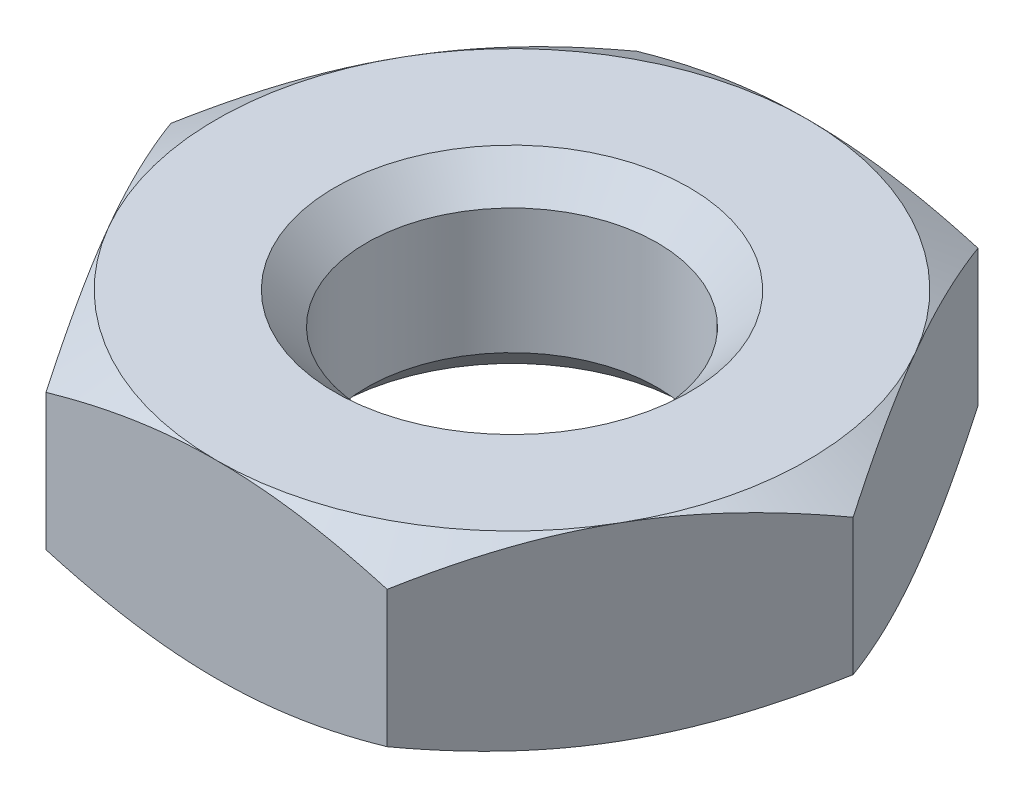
ISO-10303-21;
HEADER;
FILE_DESCRIPTION(('STEP AP214'),'2;1');
FILE_NAME('part.step','',(''),(''),'','','');
FILE_SCHEMA(('AUTOMOTIVE_DESIGN { 1 0 10303 214 1 1 1 1 }'));
ENDSEC;
DATA;
#1=APPLICATION_CONTEXT('core data for automotive mechanical design processes');
#2=APPLICATION_PROTOCOL_DEFINITION('international standard','automotive_design',2000,#1);
#3=PRODUCT_CONTEXT('',#1,'mechanical');
#4=PRODUCT('Part','Part','',(#3));
#5=PRODUCT_RELATED_PRODUCT_CATEGORY('part','',(#4));
#6=PRODUCT_DEFINITION_FORMATION('','',#4);
#7=PRODUCT_DEFINITION_CONTEXT('part definition',#1,'design');
#8=PRODUCT_DEFINITION('design','',#6,#7);
#9=PRODUCT_DEFINITION_SHAPE('','',#8);
#10=(LENGTH_UNIT() NAMED_UNIT(*) SI_UNIT(.MILLI.,.METRE.));
#11=(NAMED_UNIT(*) PLANE_ANGLE_UNIT() SI_UNIT($,.RADIAN.));
#12=(NAMED_UNIT(*) SI_UNIT($,.STERADIAN.) SOLID_ANGLE_UNIT());
#13=UNCERTAINTY_MEASURE_WITH_UNIT(LENGTH_MEASURE(1.E-05),#10,'distance_accuracy_value','');
#14=(GEOMETRIC_REPRESENTATION_CONTEXT(3) GLOBAL_UNCERTAINTY_ASSIGNED_CONTEXT((#13)) GLOBAL_UNIT_ASSIGNED_CONTEXT((#10,
#11,#12)) REPRESENTATION_CONTEXT('',''));
#15=CARTESIAN_POINT('',(0.,0.,0.));
#16=DIRECTION('',(0.,0.,1.));
#17=DIRECTION('',(1.,0.,0.));
#18=AXIS2_PLACEMENT_3D('',#15,#16,#17);
#19=CARTESIAN_POINT('',(0.,0.,0.));
#20=DIRECTION('',(0.,1.,0.));
#21=DIRECTION('',(0.,0.,1.));
#22=AXIS2_PLACEMENT_3D('',#19,#20,#21);
#23=CONICAL_SURFACE('',#22,5.,1.0471975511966);
#24=CARTESIAN_POINT('',(-7.6562098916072,2.39269148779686,5.));
#25=CARTESIAN_POINT('',(-7.43668068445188,2.28660235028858,5.));
#26=CARTESIAN_POINT('',(-7.21663244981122,2.18156779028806,5.));
#27=CARTESIAN_POINT('',(-6.77521729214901,1.97421044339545,5.));
#28=CARTESIAN_POINT('',(-6.55385014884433,1.87188812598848,5.));
#29=CARTESIAN_POINT('',(-6.10832079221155,1.67001886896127,5.));
#30=CARTESIAN_POINT('',(-5.88414983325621,1.57049116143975,5.));
#31=CARTESIAN_POINT('',(-5.43396545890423,1.37571053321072,5.));
#32=CARTESIAN_POINT('',(-5.20795214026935,1.28045738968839,5.));
#33=CARTESIAN_POINT('',(-4.75091730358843,1.09423146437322,5.));
#34=CARTESIAN_POINT('',(-4.51986836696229,1.00332560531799,5.));
#35=CARTESIAN_POINT('',(-4.05504511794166,0.82863336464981,5.));
#36=CARTESIAN_POINT('',(-3.82127050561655,0.744847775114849,5.));
#37=CARTESIAN_POINT('',(-3.3511049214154,0.586647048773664,5.));
#38=CARTESIAN_POINT('',(-3.1147207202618,0.512211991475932,5.));
#39=CARTESIAN_POINT('',(-2.63858935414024,0.375130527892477,5.));
#40=CARTESIAN_POINT('',(-2.39884327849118,0.312480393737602,5.));
#41=CARTESIAN_POINT('',(-1.91583600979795,0.202006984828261,5.));
#42=CARTESIAN_POINT('',(-1.67257390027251,0.154187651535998,5.));
#43=CARTESIAN_POINT('',(-1.18308256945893,0.0766073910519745,5.));
#44=CARTESIAN_POINT('',(-0.936853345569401,0.0468464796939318,5.));
#45=CARTESIAN_POINT('',(-0.567117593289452,0.0176567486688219,5.));
#46=CARTESIAN_POINT('',(-0.444189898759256,0.0105006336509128,5.));
#47=CARTESIAN_POINT('',(-0.198136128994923,0.00139734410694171,5.));
#48=CARTESIAN_POINT('',(-0.0750100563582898,-0.000549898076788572,5.));
#49=CARTESIAN_POINT('',(0.171177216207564,0.000816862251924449,5.));
#50=CARTESIAN_POINT('',(0.294238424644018,0.00412938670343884,5.));
#51=CARTESIAN_POINT('',(0.540114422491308,0.0159317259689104,5.));
#52=CARTESIAN_POINT('',(0.662929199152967,0.024421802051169,5.));
#53=CARTESIAN_POINT('',(0.960602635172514,0.0510977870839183,5.));
#54=CARTESIAN_POINT('',(1.13523252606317,0.071878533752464,5.));
#55=CARTESIAN_POINT('',(1.48312982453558,0.122751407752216,5.));
#56=CARTESIAN_POINT('',(1.65639704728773,0.152844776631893,5.));
#57=CARTESIAN_POINT('',(2.0014599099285,0.221278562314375,5.));
#58=CARTESIAN_POINT('',(2.17325390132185,0.259627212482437,5.));
#59=CARTESIAN_POINT('',(2.51508012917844,0.343401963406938,5.));
#60=CARTESIAN_POINT('',(2.68511247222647,0.388827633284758,5.));
#61=CARTESIAN_POINT('',(3.02759472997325,0.486855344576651,5.));
#62=CARTESIAN_POINT('',(3.20000183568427,0.539605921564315,5.));
#63=CARTESIAN_POINT('',(3.54299370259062,0.650319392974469,5.));
#64=CARTESIAN_POINT('',(3.71357963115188,0.70827869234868,5.));
#65=CARTESIAN_POINT('',(4.0522446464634,0.828212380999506,5.));
#66=CARTESIAN_POINT('',(4.22033243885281,0.890162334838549,5.00000000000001));
#67=CARTESIAN_POINT('',(4.55520387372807,1.01769851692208,5.00000000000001));
#68=CARTESIAN_POINT('',(4.72198695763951,1.08328621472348,5.));
#69=CARTESIAN_POINT('',(4.88816412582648,1.15033293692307,5.));
#70=B_SPLINE_CURVE_WITH_KNOTS('',3,(#24,#25,#26,#27,#28,#29,#30,#31,#32,#33,#34,#35,#36,#37,#38,
#39,#40,#41,#42,#43,#44,#45,#46,#47,#48,#49,#50,#51,#52,#53,#54,#55,#56,#57,#58,#59,#60,#61,#62,
#63,#64,#65,#66,#67,#68,#69),.UNSPECIFIED.,.F.,.F.,(4,2,2,2,2,2,2,2,2,2,2,2,2,2,2,2,2,2,2,2,2,2,
4),(0.,0.731468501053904,1.46306280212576,2.19884351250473,2.93458582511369,3.67936259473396,
4.42422210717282,5.16746683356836,5.9104760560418,6.65368257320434,7.39688974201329,
7.76620341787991,8.13551229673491,8.5047174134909,8.87394116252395,9.40123334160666,
9.92859584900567,10.456486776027,10.9843455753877,11.5251349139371,12.0655538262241,
12.6029309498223,13.1405267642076),.UNSPECIFIED.);
#71=CARTESIAN_POINT('',(0.,0.,5.));
#72=VERTEX_POINT('',#71);
#73=CARTESIAN_POINT('',(-2.88675134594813,0.446581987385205,5.));
#74=VERTEX_POINT('',#73);
#75=EDGE_CURVE('E241',#72,#74,#70,.F.);
#76=ORIENTED_EDGE('',*,*,#75,.T.);
#77=CARTESIAN_POINT('',(-2.88675019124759,0.446582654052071,5.000002));
#78=CARTESIAN_POINT('',(-3.01361208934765,0.373325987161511,4.78027074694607));
#79=CARTESIAN_POINT('',(-3.14155904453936,0.306696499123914,4.5586601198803));
#80=CARTESIAN_POINT('',(-3.39966830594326,0.190396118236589,4.11160176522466));
#81=CARTESIAN_POINT('',(-3.52983519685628,0.140766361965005,3.88614609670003));
#82=CARTESIAN_POINT('',(-3.78857570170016,0.0635265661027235,3.43799439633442));
#83=CARTESIAN_POINT('',(-3.91710902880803,0.0354020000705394,3.21536814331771));
#84=CARTESIAN_POINT('',(-4.11036097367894,0.0101853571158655,2.8806459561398));
#85=CARTESIAN_POINT('',(-4.17482235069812,0.00460678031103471,2.76899557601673));
#86=CARTESIAN_POINT('',(-4.30380461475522,-0.000798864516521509,2.54559174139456));
#87=CARTESIAN_POINT('',(-4.3683254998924,-0.000626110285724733,2.43383829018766));
#88=CARTESIAN_POINT('',(-4.54507978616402,0.00776164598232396,2.12769088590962));
#89=CARTESIAN_POINT('',(-4.65725457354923,0.0218388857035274,1.9333984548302));
#90=CARTESIAN_POINT('',(-4.88085968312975,0.0664713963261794,1.54610304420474));
#91=CARTESIAN_POINT('',(-4.9922892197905,0.0970419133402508,1.35310142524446));
#92=CARTESIAN_POINT('',(-5.21634456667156,0.173457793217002,0.965026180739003));
#93=CARTESIAN_POINT('',(-5.32894210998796,0.219626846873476,0.770001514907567));
#94=CARTESIAN_POINT('',(-5.55245829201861,0.324411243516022,0.382860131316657));
#95=CARTESIAN_POINT('',(-5.66337979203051,0.38300198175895,0.190738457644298));
#96=CARTESIAN_POINT('',(-5.7735038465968,0.446582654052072,-2.00000000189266E-06));
#97=B_SPLINE_CURVE_WITH_KNOTS('',3,(#77,#78,#79,#80,#81,#82,#83,#84,#85,#86,#87,#88,#89,#90,#91,
#92,#93,#94,#95,#96),.UNSPECIFIED.,.F.,.F.,(4,2,2,2,2,2,2,2,2,4),(0.,0.79254018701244,
1.5869848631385,2.36176947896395,2.7487878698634,3.13579429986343,3.80946255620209,
4.48375460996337,5.17299926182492,5.86089121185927),.UNSPECIFIED.);
#98=CARTESIAN_POINT('',(-4.3301270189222,0.,2.5));
#99=VERTEX_POINT('',#98);
#100=EDGE_CURVE('E235',#74,#99,#97,.T.);
#101=ORIENTED_EDGE('',*,*,#100,.T.);
#102=CARTESIAN_POINT('',(0.,0.,0.));
#103=DIRECTION('',(0.,1.,0.));
#104=DIRECTION('',(0.,0.,1.));
#105=AXIS2_PLACEMENT_3D('',#102,#103,#104);
#106=CIRCLE('',#105,5.);
#107=EDGE_CURVE('E338',#99,#72,#106,.T.);
#108=ORIENTED_EDGE('',*,*,#107,.T.);
#109=EDGE_LOOP('',(#76,#101,#108));
#110=FACE_BOUND('',#109,.T.);
#111=ADVANCED_FACE('F14',(#110),#23,.T.);
#112=CARTESIAN_POINT('',(5.77350269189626,0.,0.));
#113=DIRECTION('',(0.,1.,0.));
#114=DIRECTION('',(0.,0.,1.));
#115=AXIS2_PLACEMENT_3D('',#112,#113,#114);
#116=PLANE('',#115);
#117=CARTESIAN_POINT('',(0.,0.,0.));
#118=DIRECTION('',(0.,1.,0.));
#119=DIRECTION('',(0.,0.,1.));
#120=AXIS2_PLACEMENT_3D('',#117,#118,#119);
#121=CIRCLE('',#120,3.);
#122=CARTESIAN_POINT('',(0.,0.,3.));
#123=VERTEX_POINT('',#122);
#124=EDGE_CURVE('E348',#123,#123,#121,.F.);
#125=ORIENTED_EDGE('',*,*,#124,.F.);
#126=EDGE_LOOP('',(#125));
#127=FACE_BOUND('',#126,.T.);
#128=CARTESIAN_POINT('',(4.3301270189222,0.,2.5));
#129=VERTEX_POINT('',#128);
#130=EDGE_CURVE('E332',#72,#129,#106,.T.);
#131=ORIENTED_EDGE('',*,*,#130,.F.);
#132=ORIENTED_EDGE('',*,*,#107,.F.);
#133=CARTESIAN_POINT('',(-4.3301270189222,0.,-2.5));
#134=VERTEX_POINT('',#133);
#135=EDGE_CURVE('E317',#134,#99,#106,.T.);
#136=ORIENTED_EDGE('',*,*,#135,.F.);
#137=CARTESIAN_POINT('',(0.,0.,-5.));
#138=VERTEX_POINT('',#137);
#139=EDGE_CURVE('E344',#138,#134,#106,.T.);
#140=ORIENTED_EDGE('',*,*,#139,.F.);
#141=CARTESIAN_POINT('',(0.,0.,0.));
#142=DIRECTION('',(0.,-1.,0.));
#143=DIRECTION('',(0.,0.,-1.));
#144=AXIS2_PLACEMENT_3D('',#141,#142,#143);
#145=CIRCLE('',#144,5.);
#146=CARTESIAN_POINT('',(4.3301270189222,0.,-2.5));
#147=VERTEX_POINT('',#146);
#148=EDGE_CURVE('E248',#138,#147,#145,.T.);
#149=ORIENTED_EDGE('',*,*,#148,.T.);
#150=EDGE_CURVE('E341',#129,#147,#106,.T.);
#151=ORIENTED_EDGE('',*,*,#150,.F.);
#152=EDGE_LOOP('',(#131,#132,#136,#140,#149,#151));
#153=FACE_BOUND('',#152,.T.);
#154=ADVANCED_FACE('F288',(#127,#153),#116,.F.);
#155=CARTESIAN_POINT('',(-5.77350269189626,0.446581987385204,0.));
#156=VERTEX_POINT('',#155);
#157=EDGE_CURVE('E219',#99,#156,#97,.T.);
#158=ORIENTED_EDGE('',*,*,#157,.T.);
#159=CARTESIAN_POINT('',(-5.7735038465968,0.446582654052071,1.9999999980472E-06));
#160=CARTESIAN_POINT('',(-5.64664194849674,0.373325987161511,-0.219729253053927));
#161=CARTESIAN_POINT('',(-5.51869499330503,0.306696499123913,-0.441339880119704));
#162=CARTESIAN_POINT('',(-5.26058573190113,0.190396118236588,-0.888398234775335));
#163=CARTESIAN_POINT('',(-5.1304188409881,0.140766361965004,-1.11385390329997));
#164=CARTESIAN_POINT('',(-4.87167833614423,0.0635265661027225,-1.56200560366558));
#165=CARTESIAN_POINT('',(-4.74314500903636,0.0354020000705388,-1.78463185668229));
#166=CARTESIAN_POINT('',(-4.54989306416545,0.0101853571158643,-2.1193540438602));
#167=CARTESIAN_POINT('',(-4.48543168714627,0.00460678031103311,-2.23100442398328));
#168=CARTESIAN_POINT('',(-4.35644942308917,-0.000798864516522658,-2.45440825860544));
#169=CARTESIAN_POINT('',(-4.29192853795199,-0.000626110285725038,-2.56616170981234));
#170=CARTESIAN_POINT('',(-4.11517425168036,0.00776164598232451,-2.87230911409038));
#171=CARTESIAN_POINT('',(-4.00299946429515,0.0218388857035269,-3.0666015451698));
#172=CARTESIAN_POINT('',(-3.77939435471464,0.0664713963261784,-3.45389695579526));
#173=CARTESIAN_POINT('',(-3.66796481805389,0.0970419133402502,-3.64689857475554));
#174=CARTESIAN_POINT('',(-3.44390947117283,0.173457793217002,-4.034973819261));
#175=CARTESIAN_POINT('',(-3.33131192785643,0.219626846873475,-4.22999848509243));
#176=CARTESIAN_POINT('',(-3.10779574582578,0.324411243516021,-4.61713986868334));
#177=CARTESIAN_POINT('',(-2.99687424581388,0.383001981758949,-4.8092615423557));
#178=CARTESIAN_POINT('',(-2.88675019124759,0.446582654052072,-5.000002));
#179=B_SPLINE_CURVE_WITH_KNOTS('',3,(#159,#160,#161,#162,#163,#164,#165,#166,#167,#168,#169,
#170,#171,#172,#173,#174,#175,#176,#177,#178),.UNSPECIFIED.,.F.,.F.,(4,2,2,2,2,2,2,2,2,4),(0.,
0.792540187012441,1.5869848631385,2.36176947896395,2.7487878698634,3.13579429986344,
3.80946255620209,4.48375460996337,5.17299926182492,5.86089121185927),.UNSPECIFIED.);
#180=EDGE_CURVE('E213',#156,#134,#179,.T.);
#181=ORIENTED_EDGE('',*,*,#180,.T.);
#182=ORIENTED_EDGE('',*,*,#135,.T.);
#183=EDGE_LOOP('',(#158,#181,#182));
#184=FACE_BOUND('',#183,.T.);
#185=ADVANCED_FACE('F294',(#184),#23,.T.);
#186=CARTESIAN_POINT('',(-2.88675134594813,0.446581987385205,-5.));
#187=VERTEX_POINT('',#186);
#188=EDGE_CURVE('E220',#134,#187,#179,.T.);
#189=ORIENTED_EDGE('',*,*,#188,.T.);
#190=CARTESIAN_POINT('',(-7.65620989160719,2.39269148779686,-5.));
#191=CARTESIAN_POINT('',(-7.43668068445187,2.28660235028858,-5.));
#192=CARTESIAN_POINT('',(-7.21663244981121,2.18156779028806,-5.));
#193=CARTESIAN_POINT('',(-6.775217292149,1.97421044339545,-5.));
#194=CARTESIAN_POINT('',(-6.55385014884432,1.87188812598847,-5.));
#195=CARTESIAN_POINT('',(-6.10832079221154,1.67001886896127,-5.));
#196=CARTESIAN_POINT('',(-5.88414983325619,1.57049116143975,-5.));
#197=CARTESIAN_POINT('',(-5.43396545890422,1.37571053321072,-5.));
#198=CARTESIAN_POINT('',(-5.20795214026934,1.28045738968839,-5.));
#199=CARTESIAN_POINT('',(-4.75091730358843,1.09423146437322,-5.));
#200=CARTESIAN_POINT('',(-4.51986836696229,1.00332560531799,-5.));
#201=CARTESIAN_POINT('',(-4.05504511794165,0.82863336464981,-5.));
#202=CARTESIAN_POINT('',(-3.82127050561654,0.744847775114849,-5.));
#203=CARTESIAN_POINT('',(-3.3511049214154,0.586647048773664,-5.));
#204=CARTESIAN_POINT('',(-3.1147207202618,0.512211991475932,-5.));
#205=CARTESIAN_POINT('',(-2.63858935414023,0.375130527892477,-5.));
#206=CARTESIAN_POINT('',(-2.39884327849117,0.312480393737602,-5.));
#207=CARTESIAN_POINT('',(-1.91583600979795,0.202006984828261,-5.));
#208=CARTESIAN_POINT('',(-1.67257390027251,0.154187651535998,-5.));
#209=CARTESIAN_POINT('',(-1.18308256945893,0.076607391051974,-5.));
#210=CARTESIAN_POINT('',(-0.936853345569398,0.0468464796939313,-5.));
#211=CARTESIAN_POINT('',(-0.567117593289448,0.0176567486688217,-5.));
#212=CARTESIAN_POINT('',(-0.444189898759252,0.0105006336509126,-5.));
#213=CARTESIAN_POINT('',(-0.198136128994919,0.00139734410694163,-5.));
#214=CARTESIAN_POINT('',(-0.0750100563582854,-0.000549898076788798,-5.));
#215=CARTESIAN_POINT('',(0.171177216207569,0.00081686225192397,-5.));
#216=CARTESIAN_POINT('',(0.294238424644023,0.00412938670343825,-5.));
#217=CARTESIAN_POINT('',(0.540114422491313,0.0159317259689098,-5.));
#218=CARTESIAN_POINT('',(0.662929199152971,0.0244218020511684,-5.));
#219=CARTESIAN_POINT('',(0.960602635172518,0.0510977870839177,-5.));
#220=CARTESIAN_POINT('',(1.13523252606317,0.0718785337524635,-5.));
#221=CARTESIAN_POINT('',(1.48312982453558,0.122751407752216,-5.));
#222=CARTESIAN_POINT('',(1.65639704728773,0.152844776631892,-5.));
#223=CARTESIAN_POINT('',(2.0014599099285,0.221278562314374,-5.));
#224=CARTESIAN_POINT('',(2.17325390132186,0.259627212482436,-5.));
#225=CARTESIAN_POINT('',(2.51508012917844,0.343401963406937,-5.));
#226=CARTESIAN_POINT('',(2.68511247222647,0.388827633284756,-5.));
#227=CARTESIAN_POINT('',(3.02759472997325,0.48685534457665,-5.));
#228=CARTESIAN_POINT('',(3.20000183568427,0.539605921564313,-5.));
#229=CARTESIAN_POINT('',(3.54299370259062,0.650319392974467,-5.));
#230=CARTESIAN_POINT('',(3.71357963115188,0.708278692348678,-5.));
#231=CARTESIAN_POINT('',(4.0522446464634,0.828212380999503,-5.));
#232=CARTESIAN_POINT('',(4.22033243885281,0.890162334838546,-5.));
#233=CARTESIAN_POINT('',(4.55520387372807,1.01769851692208,-5.));
#234=CARTESIAN_POINT('',(4.72198695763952,1.08328621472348,-5.));
#235=CARTESIAN_POINT('',(4.88816412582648,1.15033293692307,-5.));
#236=B_SPLINE_CURVE_WITH_KNOTS('',3,(#190,#191,#192,#193,#194,#195,#196,#197,#198,#199,#200,
#201,#202,#203,#204,#205,#206,#207,#208,#209,#210,#211,#212,#213,#214,#215,#216,#217,#218,#219,
#220,#221,#222,#223,#224,#225,#226,#227,#228,#229,#230,#231,#232,#233,#234,#235),.UNSPECIFIED.,
.F.,.F.,(4,2,2,2,2,2,2,2,2,2,2,2,2,2,2,2,2,2,2,2,2,2,4),(0.,0.731468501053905,1.46306280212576,
2.19884351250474,2.93458582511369,3.67936259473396,4.42422210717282,5.16746683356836,
5.91047605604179,6.65368257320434,7.39688974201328,7.76620341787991,8.13551229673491,
8.50471741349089,8.87394116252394,9.40123334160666,9.92859584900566,10.456486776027,
10.9843455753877,11.5251349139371,12.0655538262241,12.6029309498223,13.1405267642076),.UNSPECIFIED.);
#237=EDGE_CURVE('E134',#187,#138,#236,.T.);
#238=ORIENTED_EDGE('',*,*,#237,.T.);
#239=ORIENTED_EDGE('',*,*,#139,.T.);
#240=EDGE_LOOP('',(#189,#238,#239));
#241=FACE_BOUND('',#240,.T.);
#242=ADVANCED_FACE('F170',(#241),#23,.T.);
#243=ORIENTED_EDGE('',*,*,#148,.F.);
#244=CARTESIAN_POINT('',(2.88675134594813,0.446581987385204,-5.));
#245=VERTEX_POINT('',#244);
#246=EDGE_CURVE('E142',#138,#245,#236,.T.);
#247=ORIENTED_EDGE('',*,*,#246,.T.);
#248=CARTESIAN_POINT('',(2.88675019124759,0.446582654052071,-5.000002));
#249=CARTESIAN_POINT('',(3.01361208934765,0.373325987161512,-4.78027074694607));
#250=CARTESIAN_POINT('',(3.14155904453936,0.306696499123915,-4.5586601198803));
#251=CARTESIAN_POINT('',(3.39966830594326,0.19039611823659,-4.11160176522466));
#252=CARTESIAN_POINT('',(3.52983519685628,0.140766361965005,-3.88614609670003));
#253=CARTESIAN_POINT('',(3.78857570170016,0.0635265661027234,-3.43799439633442));
#254=CARTESIAN_POINT('',(3.91710902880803,0.0354020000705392,-3.21536814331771));
#255=CARTESIAN_POINT('',(4.11036097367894,0.0101853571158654,-2.8806459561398));
#256=CARTESIAN_POINT('',(4.17482235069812,0.00460678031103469,-2.76899557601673));
#257=CARTESIAN_POINT('',(4.30380461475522,-0.000798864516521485,-2.54559174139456));
#258=CARTESIAN_POINT('',(4.3683254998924,-0.000626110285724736,-2.43383829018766));
#259=CARTESIAN_POINT('',(4.54507978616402,0.00776164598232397,-2.12769088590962));
#260=CARTESIAN_POINT('',(4.65725457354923,0.0218388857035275,-1.9333984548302));
#261=CARTESIAN_POINT('',(4.88085968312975,0.0664713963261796,-1.54610304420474));
#262=CARTESIAN_POINT('',(4.9922892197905,0.0970419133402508,-1.35310142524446));
#263=CARTESIAN_POINT('',(5.21634456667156,0.173457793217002,-0.965026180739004));
#264=CARTESIAN_POINT('',(5.32894210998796,0.219626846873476,-0.770001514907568));
#265=CARTESIAN_POINT('',(5.55245829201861,0.324411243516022,-0.382860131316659));
#266=CARTESIAN_POINT('',(5.66337979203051,0.38300198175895,-0.1907384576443));
#267=CARTESIAN_POINT('',(5.7735038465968,0.446582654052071,2.00000000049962E-06));
#268=B_SPLINE_CURVE_WITH_KNOTS('',3,(#248,#249,#250,#251,#252,#253,#254,#255,#256,#257,#258,
#259,#260,#261,#262,#263,#264,#265,#266,#267),.UNSPECIFIED.,.F.,.F.,(4,2,2,2,2,2,2,2,2,4),(0.,
0.792540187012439,1.58698486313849,2.36176947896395,2.74878786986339,3.13579429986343,
3.80946255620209,4.48375460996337,5.17299926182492,5.86089121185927),.UNSPECIFIED.);
#269=EDGE_CURVE('E212',#245,#147,#268,.T.);
#270=ORIENTED_EDGE('',*,*,#269,.T.);
#271=EDGE_LOOP('',(#243,#247,#270));
#272=FACE_BOUND('',#271,.T.);
#273=ADVANCED_FACE('F297',(#272),#23,.T.);
#274=ORIENTED_EDGE('',*,*,#150,.T.);
#275=CARTESIAN_POINT('',(5.77350269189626,0.446581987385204,0.));
#276=VERTEX_POINT('',#275);
#277=EDGE_CURVE('E205',#147,#276,#268,.T.);
#278=ORIENTED_EDGE('',*,*,#277,.T.);
#279=CARTESIAN_POINT('',(5.7735038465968,0.446582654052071,-1.99999999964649E-06));
#280=CARTESIAN_POINT('',(5.64664194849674,0.37332598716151,0.219729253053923));
#281=CARTESIAN_POINT('',(5.51869499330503,0.306696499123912,0.4413398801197));
#282=CARTESIAN_POINT('',(5.26058573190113,0.190396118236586,0.888398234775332));
#283=CARTESIAN_POINT('',(5.1304188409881,0.140766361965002,1.11385390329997));
#284=CARTESIAN_POINT('',(4.87167833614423,0.0635265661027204,1.56200560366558));
#285=CARTESIAN_POINT('',(4.74314500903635,0.0354020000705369,1.78463185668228));
#286=CARTESIAN_POINT('',(4.54989306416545,0.0101853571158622,2.1193540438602));
#287=CARTESIAN_POINT('',(4.48543168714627,0.00460678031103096,2.23100442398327));
#288=CARTESIAN_POINT('',(4.35644942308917,-0.000798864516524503,2.45440825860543));
#289=CARTESIAN_POINT('',(4.29192853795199,-0.000626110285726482,2.56616170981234));
#290=CARTESIAN_POINT('',(4.11517425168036,0.0077616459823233,2.87230911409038));
#291=CARTESIAN_POINT('',(4.00299946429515,0.0218388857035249,3.06660154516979));
#292=CARTESIAN_POINT('',(3.77939435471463,0.0664713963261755,3.45389695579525));
#293=CARTESIAN_POINT('',(3.66796481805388,0.0970419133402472,3.64689857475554));
#294=CARTESIAN_POINT('',(3.44390947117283,0.173457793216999,4.03497381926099));
#295=CARTESIAN_POINT('',(3.33131192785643,0.219626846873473,4.22999848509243));
#296=CARTESIAN_POINT('',(3.10779574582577,0.32441124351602,4.61713986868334));
#297=CARTESIAN_POINT('',(2.99687424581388,0.383001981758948,4.8092615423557));
#298=CARTESIAN_POINT('',(2.88675019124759,0.446582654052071,5.000002));
#299=B_SPLINE_CURVE_WITH_KNOTS('',3,(#279,#280,#281,#282,#283,#284,#285,#286,#287,#288,#289,
#290,#291,#292,#293,#294,#295,#296,#297,#298),.UNSPECIFIED.,.F.,.F.,(4,2,2,2,2,2,2,2,2,4),(0.,
0.79254018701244,1.5869848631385,2.36176947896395,2.7487878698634,3.13579429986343,
3.80946255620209,4.48375460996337,5.17299926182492,5.86089121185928),.UNSPECIFIED.);
#300=EDGE_CURVE('E320',#276,#129,#299,.T.);
#301=ORIENTED_EDGE('',*,*,#300,.T.);
#302=EDGE_LOOP('',(#274,#278,#301));
#303=FACE_BOUND('',#302,.T.);
#304=ADVANCED_FACE('F300',(#303),#23,.T.);
#305=ORIENTED_EDGE('',*,*,#130,.T.);
#306=CARTESIAN_POINT('',(2.88675134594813,0.446581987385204,5.));
#307=VERTEX_POINT('',#306);
#308=EDGE_CURVE('E221',#129,#307,#299,.T.);
#309=ORIENTED_EDGE('',*,*,#308,.T.);
#310=EDGE_CURVE('E114',#307,#72,#70,.F.);
#311=ORIENTED_EDGE('',*,*,#310,.T.);
#312=EDGE_LOOP('',(#305,#309,#311));
#313=FACE_BOUND('',#312,.T.);
#314=ADVANCED_FACE('F290',(#313),#23,.T.);
#315=CARTESIAN_POINT('',(0.,3.20000004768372,0.));
#316=DIRECTION('',(0.,1.,0.));
#317=DIRECTION('',(0.,0.,1.));
#318=AXIS2_PLACEMENT_3D('',#315,#316,#317);
#319=CONICAL_SURFACE('',#318,3.,0.785398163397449);
#320=CARTESIAN_POINT('',(0.,2.66000004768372,0.));
#321=DIRECTION('',(0.,-1.,0.));
#322=DIRECTION('',(0.,0.,-1.));
#323=AXIS2_PLACEMENT_3D('',#320,#321,#322);
#324=CIRCLE('',#323,2.46);
#325=CARTESIAN_POINT('',(0.,2.66000004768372,-2.46));
#326=VERTEX_POINT('',#325);
#327=EDGE_CURVE('E260',#326,#326,#324,.T.);
#328=ORIENTED_EDGE('',*,*,#327,.T.);
#329=EDGE_LOOP('',(#328));
#330=FACE_BOUND('',#329,.T.);
#331=CARTESIAN_POINT('',(0.,3.20000004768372,0.));
#332=DIRECTION('',(0.,-1.,0.));
#333=DIRECTION('',(0.,0.,-1.));
#334=AXIS2_PLACEMENT_3D('',#331,#332,#333);
#335=CIRCLE('',#334,3.);
#336=CARTESIAN_POINT('',(0.,3.20000004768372,-3.));
#337=VERTEX_POINT('',#336);
#338=EDGE_CURVE('E256',#337,#337,#335,.T.);
#339=ORIENTED_EDGE('',*,*,#338,.F.);
#340=EDGE_LOOP('',(#339));
#341=FACE_BOUND('',#340,.T.);
#342=ADVANCED_FACE('F168',(#330,#341),#319,.F.);
#343=CARTESIAN_POINT('',(0.,0.,0.));
#344=DIRECTION('',(0.,-1.,0.));
#345=DIRECTION('',(0.,0.,-1.));
#346=AXIS2_PLACEMENT_3D('',#343,#344,#345);
#347=CYLINDRICAL_SURFACE('',#346,2.46);
#348=CARTESIAN_POINT('',(0.,0.54,0.));
#349=DIRECTION('',(0.,-1.,0.));
#350=DIRECTION('',(0.,0.,-1.));
#351=AXIS2_PLACEMENT_3D('',#348,#349,#350);
#352=CIRCLE('',#351,2.46);
#353=CARTESIAN_POINT('',(0.,0.54,-2.46));
#354=VERTEX_POINT('',#353);
#355=EDGE_CURVE('E264',#354,#354,#352,.T.);
#356=ORIENTED_EDGE('',*,*,#355,.T.);
#357=EDGE_LOOP('',(#356));
#358=FACE_BOUND('',#357,.T.);
#359=ORIENTED_EDGE('',*,*,#327,.F.);
#360=EDGE_LOOP('',(#359));
#361=FACE_BOUND('',#360,.T.);
#362=ADVANCED_FACE('F272',(#358,#361),#347,.F.);
#363=CARTESIAN_POINT('',(0.,0.54,0.));
#364=DIRECTION('',(0.,-1.,0.));
#365=DIRECTION('',(0.,0.,-1.));
#366=AXIS2_PLACEMENT_3D('',#363,#364,#365);
#367=CONICAL_SURFACE('',#366,2.46,0.785398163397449);
#368=ORIENTED_EDGE('',*,*,#124,.T.);
#369=EDGE_LOOP('',(#368));
#370=FACE_BOUND('',#369,.T.);
#371=ORIENTED_EDGE('',*,*,#355,.F.);
#372=EDGE_LOOP('',(#371));
#373=FACE_BOUND('',#372,.T.);
#374=ADVANCED_FACE('F275',(#370,#373),#367,.F.);
#375=CARTESIAN_POINT('',(5.77350269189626,3.20000004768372,0.));
#376=DIRECTION('',(0.,1.,0.));
#377=DIRECTION('',(0.,0.,1.));
#378=AXIS2_PLACEMENT_3D('',#375,#376,#377);
#379=PLANE('',#378);
#380=ORIENTED_EDGE('',*,*,#338,.T.);
#381=EDGE_LOOP('',(#380));
#382=FACE_BOUND('',#381,.T.);
#383=CARTESIAN_POINT('',(0.,3.20000004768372,0.));
#384=DIRECTION('',(0.,1.,0.));
#385=DIRECTION('',(0.,0.,1.));
#386=AXIS2_PLACEMENT_3D('',#383,#384,#385);
#387=CIRCLE('',#386,5.);
#388=CARTESIAN_POINT('',(-4.3301270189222,3.20000004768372,2.5));
#389=VERTEX_POINT('',#388);
#390=CARTESIAN_POINT('',(0.,3.20000004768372,5.));
#391=VERTEX_POINT('',#390);
#392=EDGE_CURVE('E19',#389,#391,#387,.T.);
#393=ORIENTED_EDGE('',*,*,#392,.T.);
#394=CARTESIAN_POINT('',(4.33012701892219,3.20000004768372,2.5));
#395=VERTEX_POINT('',#394);
#396=EDGE_CURVE('E9',#391,#395,#387,.T.);
#397=ORIENTED_EDGE('',*,*,#396,.T.);
#398=CARTESIAN_POINT('',(4.3301270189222,3.20000004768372,-2.5));
#399=VERTEX_POINT('',#398);
#400=EDGE_CURVE('E25',#395,#399,#387,.T.);
#401=ORIENTED_EDGE('',*,*,#400,.T.);
#402=CARTESIAN_POINT('',(0.,3.20000004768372,0.));
#403=DIRECTION('',(0.,-1.,0.));
#404=DIRECTION('',(0.,0.,-1.));
#405=AXIS2_PLACEMENT_3D('',#402,#403,#404);
#406=CIRCLE('',#405,5.);
#407=CARTESIAN_POINT('',(0.,3.20000004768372,-5.));
#408=VERTEX_POINT('',#407);
#409=EDGE_CURVE('E252',#408,#399,#406,.T.);
#410=ORIENTED_EDGE('',*,*,#409,.F.);
#411=CARTESIAN_POINT('',(-4.3301270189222,3.20000004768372,-2.5));
#412=VERTEX_POINT('',#411);
#413=EDGE_CURVE('E367',#408,#412,#387,.T.);
#414=ORIENTED_EDGE('',*,*,#413,.T.);
#415=EDGE_CURVE('E360',#412,#389,#387,.T.);
#416=ORIENTED_EDGE('',*,*,#415,.T.);
#417=EDGE_LOOP('',(#393,#397,#401,#410,#414,#416));
#418=FACE_BOUND('',#417,.T.);
#419=ADVANCED_FACE('F277',(#382,#418),#379,.T.);
#420=CARTESIAN_POINT('',(0.,2.75255358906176,0.));
#421=DIRECTION('',(0.,-1.,0.));
#422=DIRECTION('',(0.,0.,-1.));
#423=AXIS2_PLACEMENT_3D('',#420,#421,#422);
#424=CONICAL_SURFACE('',#423,5.775,1.0471975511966);
#425=ORIENTED_EDGE('',*,*,#392,.F.);
#426=CARTESIAN_POINT('',(-5.7735038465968,2.75341739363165,-2.00000000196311E-06));
#427=CARTESIAN_POINT('',(-5.64664194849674,2.82667406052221,0.219729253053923));
#428=CARTESIAN_POINT('',(-5.51869499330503,2.89330354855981,0.441339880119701));
#429=CARTESIAN_POINT('',(-5.26058573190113,3.00960392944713,0.888398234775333));
#430=CARTESIAN_POINT('',(-5.13041884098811,3.05923368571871,1.11385390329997));
#431=CARTESIAN_POINT('',(-4.87167833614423,3.136473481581,1.56200560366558));
#432=CARTESIAN_POINT('',(-4.74314500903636,3.16459804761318,1.78463185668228));
#433=CARTESIAN_POINT('',(-4.54989306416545,3.18981469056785,2.1193540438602));
#434=CARTESIAN_POINT('',(-4.48543168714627,3.19539326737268,2.23100442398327));
#435=CARTESIAN_POINT('',(-4.35644942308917,3.20079891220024,2.45440825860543));
#436=CARTESIAN_POINT('',(-4.291928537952,3.20062615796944,2.56616170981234));
#437=CARTESIAN_POINT('',(-4.11517425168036,3.1922384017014,2.87230911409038));
#438=CARTESIAN_POINT('',(-4.00299946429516,3.17816116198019,3.06660154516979));
#439=CARTESIAN_POINT('',(-3.77939435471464,3.13352865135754,3.45389695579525));
#440=CARTESIAN_POINT('',(-3.66796481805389,3.10295813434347,3.64689857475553));
#441=CARTESIAN_POINT('',(-3.44390947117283,3.02654225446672,4.03497381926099));
#442=CARTESIAN_POINT('',(-3.33131192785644,2.98037320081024,4.22999848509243));
#443=CARTESIAN_POINT('',(-3.10779574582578,2.8755888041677,4.61713986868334));
#444=CARTESIAN_POINT('',(-2.99687424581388,2.81699806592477,4.8092615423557));
#445=CARTESIAN_POINT('',(-2.88675019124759,2.75341739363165,5.000002));
#446=B_SPLINE_CURVE_WITH_KNOTS('',3,(#426,#427,#428,#429,#430,#431,#432,#433,#434,#435,#436,
#437,#438,#439,#440,#441,#442,#443,#444,#445),.UNSPECIFIED.,.F.,.F.,(4,2,2,2,2,2,2,2,2,4),(0.,
0.792540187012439,1.58698486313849,2.36176947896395,2.74878786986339,3.13579429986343,
3.80946255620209,4.48375460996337,5.17299926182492,5.86089121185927),.UNSPECIFIED.);
#447=CARTESIAN_POINT('',(-2.88675134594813,2.75341806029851,5.));
#448=VERTEX_POINT('',#447);
#449=EDGE_CURVE('E140',#389,#448,#446,.T.);
#450=ORIENTED_EDGE('',*,*,#449,.T.);
#451=CARTESIAN_POINT('',(-7.6562098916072,0.807308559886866,5.));
#452=CARTESIAN_POINT('',(-7.43668068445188,0.913397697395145,5.));
#453=CARTESIAN_POINT('',(-7.21663244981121,1.01843225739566,5.));
#454=CARTESIAN_POINT('',(-6.77521729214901,1.22578960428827,5.));
#455=CARTESIAN_POINT('',(-6.55385014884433,1.32811192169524,5.));
#456=CARTESIAN_POINT('',(-6.10832079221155,1.52998117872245,5.));
#457=CARTESIAN_POINT('',(-5.8841498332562,1.62950888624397,5.));
#458=CARTESIAN_POINT('',(-5.43396545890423,1.824289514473,5.));
#459=CARTESIAN_POINT('',(-5.20795214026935,1.91954265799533,5.));
#460=CARTESIAN_POINT('',(-4.75091730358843,2.1057685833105,5.));
#461=CARTESIAN_POINT('',(-4.51986836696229,2.19667444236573,5.));
#462=CARTESIAN_POINT('',(-4.05504511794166,2.37136668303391,5.));
#463=CARTESIAN_POINT('',(-3.82127050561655,2.45515227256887,5.));
#464=CARTESIAN_POINT('',(-3.3511049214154,2.61335299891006,5.));
#465=CARTESIAN_POINT('',(-3.1147207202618,2.68778805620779,5.));
#466=CARTESIAN_POINT('',(-2.63858935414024,2.82486951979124,5.));
#467=CARTESIAN_POINT('',(-2.39884327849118,2.88751965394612,5.));
#468=CARTESIAN_POINT('',(-1.91583600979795,2.99799306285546,5.));
#469=CARTESIAN_POINT('',(-1.67257390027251,3.04581239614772,5.));
#470=CARTESIAN_POINT('',(-1.18308256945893,3.12339265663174,5.));
#471=CARTESIAN_POINT('',(-0.936853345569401,3.15315356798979,5.));
#472=CARTESIAN_POINT('',(-0.567117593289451,3.1823432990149,5.));
#473=CARTESIAN_POINT('',(-0.444189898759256,3.18949941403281,5.));
#474=CARTESIAN_POINT('',(-0.198136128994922,3.19860270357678,5.));
#475=CARTESIAN_POINT('',(-0.0750100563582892,3.20054994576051,5.));
#476=CARTESIAN_POINT('',(0.171177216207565,3.1991831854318,5.));
#477=CARTESIAN_POINT('',(0.294238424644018,3.19587066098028,5.));
#478=CARTESIAN_POINT('',(0.540114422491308,3.18406832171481,5.));
#479=CARTESIAN_POINT('',(0.662929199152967,3.17557824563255,5.));
#480=CARTESIAN_POINT('',(0.960602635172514,3.1489022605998,5.));
#481=CARTESIAN_POINT('',(1.13523252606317,3.12812151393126,5.));
#482=CARTESIAN_POINT('',(1.48312982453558,3.0772486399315,5.));
#483=CARTESIAN_POINT('',(1.65639704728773,3.04715527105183,5.));
#484=CARTESIAN_POINT('',(2.0014599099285,2.97872148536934,5.));
#485=CARTESIAN_POINT('',(2.17325390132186,2.94037283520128,5.));
#486=CARTESIAN_POINT('',(2.51508012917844,2.85659808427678,5.));
#487=CARTESIAN_POINT('',(2.68511247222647,2.81117241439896,5.));
#488=CARTESIAN_POINT('',(3.02759472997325,2.71314470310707,5.));
#489=CARTESIAN_POINT('',(3.20000183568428,2.6603941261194,5.));
#490=CARTESIAN_POINT('',(3.54299370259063,2.54968065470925,5.));
#491=CARTESIAN_POINT('',(3.71357963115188,2.49172135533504,5.));
#492=CARTESIAN_POINT('',(4.0522446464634,2.37178766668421,5.));
#493=CARTESIAN_POINT('',(4.22033243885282,2.30983771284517,5.00000000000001));
#494=CARTESIAN_POINT('',(4.55520387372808,2.18230153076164,5.00000000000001));
#495=CARTESIAN_POINT('',(4.72198695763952,2.11671383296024,5.));
#496=CARTESIAN_POINT('',(4.88816412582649,2.04966711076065,5.));
#497=B_SPLINE_CURVE_WITH_KNOTS('',3,(#451,#452,#453,#454,#455,#456,#457,#458,#459,#460,#461,
#462,#463,#464,#465,#466,#467,#468,#469,#470,#471,#472,#473,#474,#475,#476,#477,#478,#479,#480,
#481,#482,#483,#484,#485,#486,#487,#488,#489,#490,#491,#492,#493,#494,#495,#496),.UNSPECIFIED.,
.F.,.F.,(4,2,2,2,2,2,2,2,2,2,2,2,2,2,2,2,2,2,2,2,2,2,4),(0.,0.731468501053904,1.46306280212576,
2.19884351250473,2.93458582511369,3.67936259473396,4.42422210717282,5.16746683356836,
5.91047605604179,6.65368257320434,7.39688974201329,7.76620341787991,8.13551229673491,
8.5047174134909,8.87394116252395,9.40123334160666,9.92859584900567,10.456486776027,
10.9843455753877,11.5251349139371,12.0655538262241,12.6029309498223,13.1405267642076),.UNSPECIFIED.);
#498=EDGE_CURVE('E133',#448,#391,#497,.T.);
#499=ORIENTED_EDGE('',*,*,#498,.T.);
#500=EDGE_LOOP('',(#425,#450,#499));
#501=FACE_BOUND('',#500,.T.);
#502=ADVANCED_FACE('F167',(#501),#424,.T.);
#503=ORIENTED_EDGE('',*,*,#415,.F.);
#504=CARTESIAN_POINT('',(-2.88675019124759,2.75341739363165,-5.000002));
#505=CARTESIAN_POINT('',(-3.01361208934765,2.82667406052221,-4.78027074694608));
#506=CARTESIAN_POINT('',(-3.14155904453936,2.89330354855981,-4.5586601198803));
#507=CARTESIAN_POINT('',(-3.39966830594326,3.00960392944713,-4.11160176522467));
#508=CARTESIAN_POINT('',(-3.52983519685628,3.05923368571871,-3.88614609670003));
#509=CARTESIAN_POINT('',(-3.78857570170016,3.136473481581,-3.43799439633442));
#510=CARTESIAN_POINT('',(-3.91710902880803,3.16459804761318,-3.21536814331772));
#511=CARTESIAN_POINT('',(-4.11036097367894,3.18981469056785,-2.8806459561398));
#512=CARTESIAN_POINT('',(-4.17482235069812,3.19539326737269,-2.76899557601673));
#513=CARTESIAN_POINT('',(-4.30380461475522,3.20079891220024,-2.54559174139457));
#514=CARTESIAN_POINT('',(-4.36832549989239,3.20062615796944,-2.43383829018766));
#515=CARTESIAN_POINT('',(-4.54507978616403,3.1922384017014,-2.12769088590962));
#516=CARTESIAN_POINT('',(-4.65725457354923,3.17816116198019,-1.93339845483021));
#517=CARTESIAN_POINT('',(-4.88085968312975,3.13352865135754,-1.54610304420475));
#518=CARTESIAN_POINT('',(-4.9922892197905,3.10295813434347,-1.35310142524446));
#519=CARTESIAN_POINT('',(-5.21634456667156,3.02654225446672,-0.965026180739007));
#520=CARTESIAN_POINT('',(-5.32894210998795,2.98037320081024,-0.77000151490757));
#521=CARTESIAN_POINT('',(-5.55245829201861,2.8755888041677,-0.38286013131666));
#522=CARTESIAN_POINT('',(-5.66337979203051,2.81699806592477,-0.190738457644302));
#523=CARTESIAN_POINT('',(-5.7735038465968,2.75341739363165,1.99999999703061E-06));
#524=B_SPLINE_CURVE_WITH_KNOTS('',3,(#504,#505,#506,#507,#508,#509,#510,#511,#512,#513,#514,
#515,#516,#517,#518,#519,#520,#521,#522,#523),.UNSPECIFIED.,.F.,.F.,(4,2,2,2,2,2,2,2,2,4),(0.,
0.792540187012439,1.58698486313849,2.36176947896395,2.74878786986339,3.13579429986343,
3.80946255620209,4.48375460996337,5.17299926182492,5.86089121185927),.UNSPECIFIED.);
#525=CARTESIAN_POINT('',(-5.77350269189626,2.75341806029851,0.));
#526=VERTEX_POINT('',#525);
#527=EDGE_CURVE('E32',#412,#526,#524,.T.);
#528=ORIENTED_EDGE('',*,*,#527,.T.);
#529=EDGE_CURVE('E394',#526,#389,#446,.T.);
#530=ORIENTED_EDGE('',*,*,#529,.T.);
#531=EDGE_LOOP('',(#503,#528,#530));
#532=FACE_BOUND('',#531,.T.);
#533=ADVANCED_FACE('F393',(#532),#424,.T.);
#534=ORIENTED_EDGE('',*,*,#413,.F.);
#535=CARTESIAN_POINT('',(-7.65620989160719,0.807308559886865,-5.));
#536=CARTESIAN_POINT('',(-7.43668068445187,0.913397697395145,-5.));
#537=CARTESIAN_POINT('',(-7.2166324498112,1.01843225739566,-5.));
#538=CARTESIAN_POINT('',(-6.775217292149,1.22578960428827,-5.));
#539=CARTESIAN_POINT('',(-6.55385014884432,1.32811192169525,-5.));
#540=CARTESIAN_POINT('',(-6.10832079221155,1.52998117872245,-5.));
#541=CARTESIAN_POINT('',(-5.8841498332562,1.62950888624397,-5.));
#542=CARTESIAN_POINT('',(-5.43396545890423,1.824289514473,-5.));
#543=CARTESIAN_POINT('',(-5.20795214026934,1.91954265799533,-5.));
#544=CARTESIAN_POINT('',(-4.75091730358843,2.1057685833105,-5.));
#545=CARTESIAN_POINT('',(-4.51986836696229,2.19667444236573,-5.));
#546=CARTESIAN_POINT('',(-4.05504511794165,2.37136668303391,-5.));
#547=CARTESIAN_POINT('',(-3.82127050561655,2.45515227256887,-5.));
#548=CARTESIAN_POINT('',(-3.3511049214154,2.61335299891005,-5.));
#549=CARTESIAN_POINT('',(-3.1147207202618,2.68778805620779,-5.));
#550=CARTESIAN_POINT('',(-2.63858935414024,2.82486951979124,-5.));
#551=CARTESIAN_POINT('',(-2.39884327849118,2.88751965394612,-5.));
#552=CARTESIAN_POINT('',(-1.91583600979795,2.99799306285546,-5.));
#553=CARTESIAN_POINT('',(-1.67257390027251,3.04581239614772,-5.));
#554=CARTESIAN_POINT('',(-1.18308256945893,3.12339265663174,-5.));
#555=CARTESIAN_POINT('',(-0.936853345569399,3.15315356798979,-5.));
#556=CARTESIAN_POINT('',(-0.567117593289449,3.1823432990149,-5.));
#557=CARTESIAN_POINT('',(-0.444189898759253,3.18949941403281,-5.));
#558=CARTESIAN_POINT('',(-0.198136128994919,3.19860270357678,-5.));
#559=CARTESIAN_POINT('',(-0.0750100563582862,3.20054994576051,-5.));
#560=CARTESIAN_POINT('',(0.171177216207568,3.1991831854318,-5.));
#561=CARTESIAN_POINT('',(0.294238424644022,3.19587066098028,-5.));
#562=CARTESIAN_POINT('',(0.540114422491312,3.18406832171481,-5.));
#563=CARTESIAN_POINT('',(0.662929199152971,3.17557824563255,-5.));
#564=CARTESIAN_POINT('',(0.960602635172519,3.1489022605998,-5.));
#565=CARTESIAN_POINT('',(1.13523252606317,3.12812151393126,-5.));
#566=CARTESIAN_POINT('',(1.48312982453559,3.0772486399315,-5.));
#567=CARTESIAN_POINT('',(1.65639704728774,3.04715527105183,-5.));
#568=CARTESIAN_POINT('',(2.0014599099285,2.97872148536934,-5.));
#569=CARTESIAN_POINT('',(2.17325390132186,2.94037283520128,-5.));
#570=CARTESIAN_POINT('',(2.51508012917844,2.85659808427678,-5.));
#571=CARTESIAN_POINT('',(2.68511247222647,2.81117241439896,-5.));
#572=CARTESIAN_POINT('',(3.02759472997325,2.71314470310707,-5.));
#573=CARTESIAN_POINT('',(3.20000183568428,2.6603941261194,-5.));
#574=CARTESIAN_POINT('',(3.54299370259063,2.54968065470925,-5.));
#575=CARTESIAN_POINT('',(3.71357963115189,2.49172135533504,-5.));
#576=CARTESIAN_POINT('',(4.0522446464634,2.37178766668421,-5.));
#577=CARTESIAN_POINT('',(4.22033243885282,2.30983771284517,-5.));
#578=CARTESIAN_POINT('',(4.55520387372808,2.18230153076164,-5.));
#579=CARTESIAN_POINT('',(4.72198695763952,2.11671383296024,-5.));
#580=CARTESIAN_POINT('',(4.88816412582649,2.04966711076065,-5.));
#581=B_SPLINE_CURVE_WITH_KNOTS('',3,(#535,#536,#537,#538,#539,#540,#541,#542,#543,#544,#545,
#546,#547,#548,#549,#550,#551,#552,#553,#554,#555,#556,#557,#558,#559,#560,#561,#562,#563,#564,
#565,#566,#567,#568,#569,#570,#571,#572,#573,#574,#575,#576,#577,#578,#579,#580),.UNSPECIFIED.,
.F.,.F.,(4,2,2,2,2,2,2,2,2,2,2,2,2,2,2,2,2,2,2,2,2,2,4),(0.,0.731468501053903,1.46306280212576,
2.19884351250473,2.93458582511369,3.67936259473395,4.42422210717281,5.16746683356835,
5.91047605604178,6.65368257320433,7.39688974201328,7.76620341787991,8.1355122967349,
8.50471741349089,8.87394116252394,9.40123334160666,9.92859584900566,10.456486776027,
10.9843455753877,11.5251349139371,12.0655538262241,12.6029309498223,13.1405267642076),.UNSPECIFIED.);
#582=CARTESIAN_POINT('',(-2.88675134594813,2.75341806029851,-5.));
#583=VERTEX_POINT('',#582);
#584=EDGE_CURVE('E40',#408,#583,#581,.F.);
#585=ORIENTED_EDGE('',*,*,#584,.T.);
#586=EDGE_CURVE('E388',#583,#412,#524,.T.);
#587=ORIENTED_EDGE('',*,*,#586,.T.);
#588=EDGE_LOOP('',(#534,#585,#587));
#589=FACE_BOUND('',#588,.T.);
#590=ADVANCED_FACE('F387',(#589),#424,.T.);
#591=ORIENTED_EDGE('',*,*,#409,.T.);
#592=CARTESIAN_POINT('',(5.7735038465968,2.75341739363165,2.00000000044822E-06));
#593=CARTESIAN_POINT('',(5.64664194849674,2.82667406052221,-0.219729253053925));
#594=CARTESIAN_POINT('',(5.51869499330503,2.89330354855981,-0.441339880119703));
#595=CARTESIAN_POINT('',(5.26058573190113,3.00960392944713,-0.888398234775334));
#596=CARTESIAN_POINT('',(5.13041884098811,3.05923368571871,-1.11385390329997));
#597=CARTESIAN_POINT('',(4.87167833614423,3.136473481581,-1.56200560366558));
#598=CARTESIAN_POINT('',(4.74314500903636,3.16459804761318,-1.78463185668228));
#599=CARTESIAN_POINT('',(4.54989306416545,3.18981469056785,-2.1193540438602));
#600=CARTESIAN_POINT('',(4.48543168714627,3.19539326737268,-2.23100442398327));
#601=CARTESIAN_POINT('',(4.35644942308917,3.20079891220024,-2.45440825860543));
#602=CARTESIAN_POINT('',(4.291928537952,3.20062615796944,-2.56616170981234));
#603=CARTESIAN_POINT('',(4.11517425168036,3.1922384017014,-2.87230911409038));
#604=CARTESIAN_POINT('',(4.00299946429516,3.17816116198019,-3.06660154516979));
#605=CARTESIAN_POINT('',(3.77939435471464,3.13352865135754,-3.45389695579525));
#606=CARTESIAN_POINT('',(3.66796481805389,3.10295813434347,-3.64689857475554));
#607=CARTESIAN_POINT('',(3.44390947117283,3.02654225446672,-4.03497381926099));
#608=CARTESIAN_POINT('',(3.33131192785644,2.98037320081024,-4.22999848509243));
#609=CARTESIAN_POINT('',(3.10779574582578,2.8755888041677,-4.61713986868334));
#610=CARTESIAN_POINT('',(2.99687424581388,2.81699806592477,-4.8092615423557));
#611=CARTESIAN_POINT('',(2.88675019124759,2.75341739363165,-5.000002));
#612=B_SPLINE_CURVE_WITH_KNOTS('',3,(#592,#593,#594,#595,#596,#597,#598,#599,#600,#601,#602,
#603,#604,#605,#606,#607,#608,#609,#610,#611),.UNSPECIFIED.,.F.,.F.,(4,2,2,2,2,2,2,2,2,4),(0.,
0.79254018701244,1.58698486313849,2.36176947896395,2.74878786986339,3.13579429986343,
3.80946255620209,4.48375460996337,5.17299926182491,5.86089121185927),.UNSPECIFIED.);
#613=CARTESIAN_POINT('',(2.88675134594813,2.75341806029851,-5.));
#614=VERTEX_POINT('',#613);
#615=EDGE_CURVE('E187',#399,#614,#612,.T.);
#616=ORIENTED_EDGE('',*,*,#615,.T.);
#617=EDGE_CURVE('E194',#614,#408,#581,.F.);
#618=ORIENTED_EDGE('',*,*,#617,.T.);
#619=EDGE_LOOP('',(#591,#616,#618));
#620=FACE_BOUND('',#619,.T.);
#621=ADVANCED_FACE('F382',(#620),#424,.T.);
#622=ORIENTED_EDGE('',*,*,#400,.F.);
#623=CARTESIAN_POINT('',(2.88675019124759,2.75341739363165,5.000002));
#624=CARTESIAN_POINT('',(3.01361208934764,2.82667406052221,4.78027074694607));
#625=CARTESIAN_POINT('',(3.14155904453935,2.89330354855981,4.5586601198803));
#626=CARTESIAN_POINT('',(3.39966830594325,3.00960392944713,4.11160176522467));
#627=CARTESIAN_POINT('',(3.52983519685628,3.05923368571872,3.88614609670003));
#628=CARTESIAN_POINT('',(3.78857570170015,3.136473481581,3.43799439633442));
#629=CARTESIAN_POINT('',(3.91710902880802,3.16459804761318,3.21536814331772));
#630=CARTESIAN_POINT('',(4.11036097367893,3.18981469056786,2.8806459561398));
#631=CARTESIAN_POINT('',(4.17482235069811,3.19539326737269,2.76899557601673));
#632=CARTESIAN_POINT('',(4.30380461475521,3.20079891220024,2.54559174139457));
#633=CARTESIAN_POINT('',(4.36832549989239,3.20062615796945,2.43383829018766));
#634=CARTESIAN_POINT('',(4.54507978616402,3.1922384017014,2.12769088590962));
#635=CARTESIAN_POINT('',(4.65725457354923,3.17816116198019,1.93339845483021));
#636=CARTESIAN_POINT('',(4.88085968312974,3.13352865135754,1.54610304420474));
#637=CARTESIAN_POINT('',(4.9922892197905,3.10295813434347,1.35310142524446));
#638=CARTESIAN_POINT('',(5.21634456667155,3.02654225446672,0.965026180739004));
#639=CARTESIAN_POINT('',(5.32894210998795,2.98037320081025,0.770001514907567));
#640=CARTESIAN_POINT('',(5.55245829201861,2.8755888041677,0.382860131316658));
#641=CARTESIAN_POINT('',(5.66337979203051,2.81699806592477,0.190738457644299));
#642=CARTESIAN_POINT('',(5.7735038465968,2.75341739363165,-1.99999999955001E-06));
#643=B_SPLINE_CURVE_WITH_KNOTS('',3,(#623,#624,#625,#626,#627,#628,#629,#630,#631,#632,#633,
#634,#635,#636,#637,#638,#639,#640,#641,#642),.UNSPECIFIED.,.F.,.F.,(4,2,2,2,2,2,2,2,2,4),(0.,
0.792540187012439,1.58698486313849,2.36176947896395,2.74878786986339,3.13579429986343,
3.80946255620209,4.48375460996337,5.17299926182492,5.86089121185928),.UNSPECIFIED.);
#644=CARTESIAN_POINT('',(5.77350269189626,2.75341806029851,0.));
#645=VERTEX_POINT('',#644);
#646=EDGE_CURVE('E125',#395,#645,#643,.T.);
#647=ORIENTED_EDGE('',*,*,#646,.T.);
#648=EDGE_CURVE('E193',#645,#399,#612,.T.);
#649=ORIENTED_EDGE('',*,*,#648,.T.);
#650=EDGE_LOOP('',(#622,#647,#649));
#651=FACE_BOUND('',#650,.T.);
#652=ADVANCED_FACE('F166',(#651),#424,.T.);
#653=CARTESIAN_POINT('',(2.88675134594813,2.75341806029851,5.));
#654=VERTEX_POINT('',#653);
#655=EDGE_CURVE('E111',#391,#654,#497,.T.);
#656=ORIENTED_EDGE('',*,*,#655,.T.);
#657=EDGE_CURVE('E120',#654,#395,#643,.T.);
#658=ORIENTED_EDGE('',*,*,#657,.T.);
#659=ORIENTED_EDGE('',*,*,#396,.F.);
#660=EDGE_LOOP('',(#656,#658,#659));
#661=FACE_BOUND('',#660,.T.);
#662=ADVANCED_FACE('F130',(#661),#424,.T.);
#663=CARTESIAN_POINT('',(2.88675134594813,3.20000004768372,5.));
#664=DIRECTION('',(-0.866025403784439,0.,-0.5));
#665=DIRECTION('',(-0.5,0.,0.866025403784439));
#666=AXIS2_PLACEMENT_3D('',#663,#664,#665);
#667=PLANE('',#666);
#668=ORIENTED_EDGE('',*,*,#300,.F.);
#669=DIRECTION('',(0.,-1.,0.));
#670=VECTOR('',#669,1.);
#671=CARTESIAN_POINT('',(5.77350269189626,3.20000004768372,0.));
#672=LINE('',#671,#670);
#673=EDGE_CURVE('E334',#645,#276,#672,.T.);
#674=ORIENTED_EDGE('',*,*,#673,.F.);
#675=ORIENTED_EDGE('',*,*,#646,.F.);
#676=ORIENTED_EDGE('',*,*,#657,.F.);
#677=DIRECTION('',(0.,-1.,0.));
#678=VECTOR('',#677,1.);
#679=CARTESIAN_POINT('',(2.88675134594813,3.20000004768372,5.));
#680=LINE('',#679,#678);
#681=EDGE_CURVE('E107',#654,#307,#680,.T.);
#682=ORIENTED_EDGE('',*,*,#681,.T.);
#683=ORIENTED_EDGE('',*,*,#308,.F.);
#684=EDGE_LOOP('',(#668,#674,#675,#676,#682,#683));
#685=FACE_BOUND('',#684,.T.);
#686=ADVANCED_FACE('F16',(#685),#667,.F.);
#687=CARTESIAN_POINT('',(5.77350269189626,3.20000004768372,0.));
#688=DIRECTION('',(-0.866025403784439,0.,0.5));
#689=DIRECTION('',(0.5,0.,0.866025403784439));
#690=AXIS2_PLACEMENT_3D('',#687,#688,#689);
#691=PLANE('',#690);
#692=ORIENTED_EDGE('',*,*,#269,.F.);
#693=DIRECTION('',(0.,-1.,0.));
#694=VECTOR('',#693,1.);
#695=CARTESIAN_POINT('',(2.88675134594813,3.20000004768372,-5.));
#696=LINE('',#695,#694);
#697=EDGE_CURVE('E339',#614,#245,#696,.T.);
#698=ORIENTED_EDGE('',*,*,#697,.F.);
#699=ORIENTED_EDGE('',*,*,#615,.F.);
#700=ORIENTED_EDGE('',*,*,#648,.F.);
#701=ORIENTED_EDGE('',*,*,#673,.T.);
#702=ORIENTED_EDGE('',*,*,#277,.F.);
#703=EDGE_LOOP('',(#692,#698,#699,#700,#701,#702));
#704=FACE_BOUND('',#703,.T.);
#705=ADVANCED_FACE('F198',(#704),#691,.F.);
#706=CARTESIAN_POINT('',(2.88675134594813,3.20000004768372,-5.));
#707=DIRECTION('',(0.,0.,1.));
#708=DIRECTION('',(1.,0.,0.));
#709=AXIS2_PLACEMENT_3D('',#706,#707,#708);
#710=PLANE('',#709);
#711=ORIENTED_EDGE('',*,*,#237,.F.);
#712=DIRECTION('',(0.,-1.,0.));
#713=VECTOR('',#712,1.);
#714=CARTESIAN_POINT('',(-2.88675134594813,3.20000004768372,-5.));
#715=LINE('',#714,#713);
#716=EDGE_CURVE('E407',#583,#187,#715,.T.);
#717=ORIENTED_EDGE('',*,*,#716,.F.);
#718=ORIENTED_EDGE('',*,*,#584,.F.);
#719=ORIENTED_EDGE('',*,*,#617,.F.);
#720=ORIENTED_EDGE('',*,*,#697,.T.);
#721=ORIENTED_EDGE('',*,*,#246,.F.);
#722=EDGE_LOOP('',(#711,#717,#718,#719,#720,#721));
#723=FACE_BOUND('',#722,.T.);
#724=ADVANCED_FACE('F201',(#723),#710,.F.);
#725=CARTESIAN_POINT('',(-2.88675134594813,3.20000004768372,-5.));
#726=DIRECTION('',(0.866025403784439,0.,0.5));
#727=DIRECTION('',(0.5,0.,-0.866025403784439));
#728=AXIS2_PLACEMENT_3D('',#725,#726,#727);
#729=PLANE('',#728);
#730=ORIENTED_EDGE('',*,*,#180,.F.);
#731=DIRECTION('',(0.,-1.,0.));
#732=VECTOR('',#731,1.);
#733=CARTESIAN_POINT('',(-5.77350269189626,3.20000004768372,0.));
#734=LINE('',#733,#732);
#735=EDGE_CURVE('E401',#526,#156,#734,.T.);
#736=ORIENTED_EDGE('',*,*,#735,.F.);
#737=ORIENTED_EDGE('',*,*,#527,.F.);
#738=ORIENTED_EDGE('',*,*,#586,.F.);
#739=ORIENTED_EDGE('',*,*,#716,.T.);
#740=ORIENTED_EDGE('',*,*,#188,.F.);
#741=EDGE_LOOP('',(#730,#736,#737,#738,#739,#740));
#742=FACE_BOUND('',#741,.T.);
#743=ADVANCED_FACE('F226',(#742),#729,.F.);
#744=CARTESIAN_POINT('',(-5.77350269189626,3.20000004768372,0.));
#745=DIRECTION('',(0.866025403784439,0.,-0.5));
#746=DIRECTION('',(-0.5,0.,-0.866025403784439));
#747=AXIS2_PLACEMENT_3D('',#744,#745,#746);
#748=PLANE('',#747);
#749=ORIENTED_EDGE('',*,*,#100,.F.);
#750=DIRECTION('',(0.,-1.,0.));
#751=VECTOR('',#750,1.);
#752=CARTESIAN_POINT('',(-2.88675134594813,3.20000004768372,5.));
#753=LINE('',#752,#751);
#754=EDGE_CURVE('E119',#448,#74,#753,.T.);
#755=ORIENTED_EDGE('',*,*,#754,.F.);
#756=ORIENTED_EDGE('',*,*,#449,.F.);
#757=ORIENTED_EDGE('',*,*,#529,.F.);
#758=ORIENTED_EDGE('',*,*,#735,.T.);
#759=ORIENTED_EDGE('',*,*,#157,.F.);
#760=EDGE_LOOP('',(#749,#755,#756,#757,#758,#759));
#761=FACE_BOUND('',#760,.T.);
#762=ADVANCED_FACE('F229',(#761),#748,.F.);
#763=CARTESIAN_POINT('',(-2.88675134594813,3.20000004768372,5.));
#764=DIRECTION('',(0.,0.,-1.));
#765=DIRECTION('',(-1.,0.,0.));
#766=AXIS2_PLACEMENT_3D('',#763,#764,#765);
#767=PLANE('',#766);
#768=ORIENTED_EDGE('',*,*,#310,.F.);
#769=ORIENTED_EDGE('',*,*,#681,.F.);
#770=ORIENTED_EDGE('',*,*,#655,.F.);
#771=ORIENTED_EDGE('',*,*,#498,.F.);
#772=ORIENTED_EDGE('',*,*,#754,.T.);
#773=ORIENTED_EDGE('',*,*,#75,.F.);
#774=EDGE_LOOP('',(#768,#769,#770,#771,#772,#773));
#775=FACE_BOUND('',#774,.T.);
#776=ADVANCED_FACE('F109',(#775),#767,.F.);
#777=CLOSED_SHELL('',(#111,#154,#185,#242,#273,#304,#314,#342,#362,#374,#419,#502,#533,#590,
#621,#652,#662,#686,#705,#724,#743,#762,#776));
#778=MANIFOLD_SOLID_BREP('B1',#777);
#779=ADVANCED_BREP_SHAPE_REPRESENTATION('',(#18,#778),#14);
#780=SHAPE_DEFINITION_REPRESENTATION(#9,#779);
ENDSEC;
END-ISO-10303-21;
